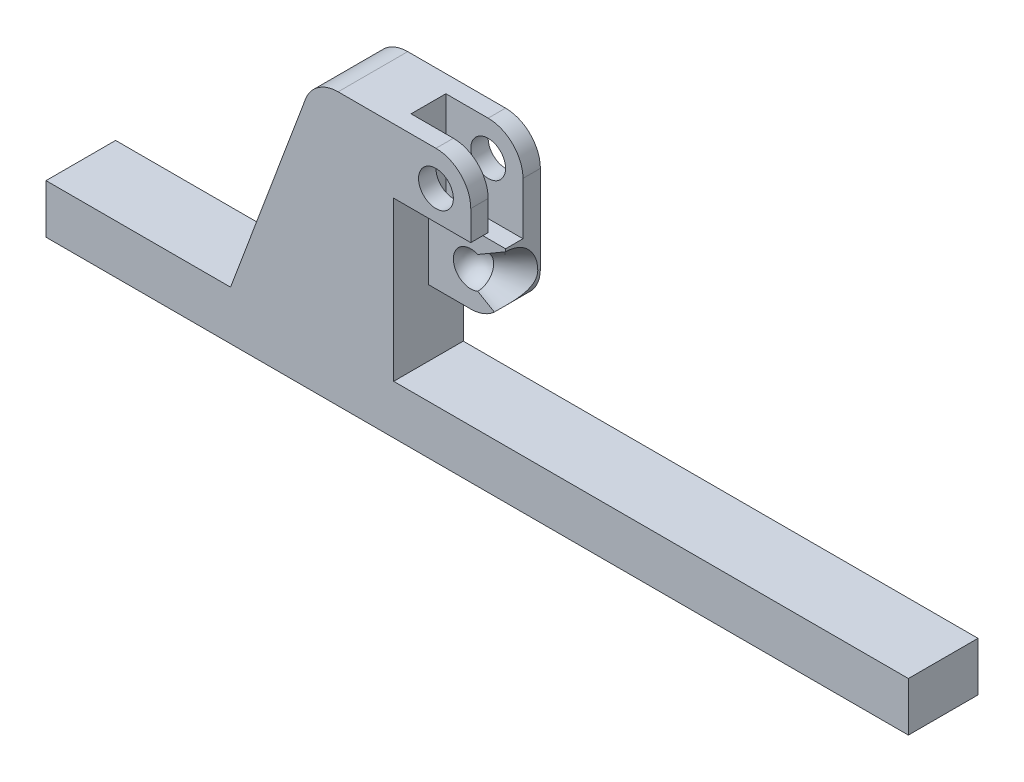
from build123d import *

# Parameters (mm, degrees)
ESQUISSE1_R             = 5
BASE_EXTRUSION_DEPTH    = 10
ESQUISSE6_W             = 25.109407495
ESQUISSE6_H             = 26.526756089
ENL_V_MAT_EXTRU_3_DEPTH = 10
ESQUISSE7_W             = 38.267391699
ESQUISSE7_H             = 10
ENL_V_MAT_EXTRU_4_DEPTH = 25


with BuildPart() as part:
    # Esquisse1 → Base-Extrusion (new, symmetric)
    with BuildSketch(Plane.XY):
        with BuildLine():
            Line((0, 35), (-28.108181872, 35))
            ThreePointArc((-28.108181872, 35), (-33.80742751, 33.216970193), (-37.474288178, 28.503719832))
            Line((-37.474288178, 28.503719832), (-59.006773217, -29.056688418))
            Line((-59.006773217, -29.056688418), (-112.028230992, -29.056688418))
            Line((-112.028230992, -29.056688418), (-112.028230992, -43.144779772))
            Line((-112.028230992, -43.144779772), (135.723083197, -43.144779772))
            Line((135.723083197, -43.144779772), (135.723083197, -29.056688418))
            Line((135.723083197, -29.056688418), (-12.150978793, -29.056688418))
            Line((-12.150978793, -29.056688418), (-12.150978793, -10))
            Line((-12.150978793, -10), (0, -10))
            ThreePointArc((0, -10), (7.071067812, -7.071067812), (10, 0))
            Line((10, 0), (10, 25))
            ThreePointArc((10, 25), (7.071067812, 32.071067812), (0, 35))
        make_face()
        with Locations((0, 25)):
            Circle(ESQUISSE1_R, mode=Mode.SUBTRACT)
    extrude(amount=BASE_EXTRUSION_DEPTH, both=True)

    # Esquisse5 → Enl_vement de mati_re-R_volution2 (revolve, cut)
    with BuildSketch(Plane.XY, mode=Mode.PRIVATE) as enl_vement_de_mati_re_r_volution2_sk:
        with BuildLine():
            Line((2.000376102, 4.582411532), (12.830688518, 10.906188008))
            Line((12.830688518, 10.906188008), (12.830688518, 0))
            Line((12.830688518, 0), (-5, 0))
            ThreePointArc((-5, 0), (-2.738441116, 4.183412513), (2.000376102, 4.582411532))
        make_face()
    revolve(enl_vement_de_mati_re_r_volution2_sk.sketch.rotate(Axis((-9.237122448, 0, 0), (1, 0, 0)), 90), axis=Axis((-9.237122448, 0, 0), (1, 0, 0)), mode=Mode.SUBTRACT)

    # Esquisse6 → Enl_v. mat.-Extru.3 (cut)
    with BuildSketch(Plane.XY.offset(10)):
        with Locations((0.403724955, 3.263378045)):
            Rectangle(ESQUISSE6_W, ESQUISSE6_H)
    extrude(amount=-ENL_V_MAT_EXTRU_3_DEPTH, mode=Mode.SUBTRACT)

    # Esquisse7 → Enl_v. mat.-Extru.4 (cut)
    with BuildSketch(Plane(origin=(0, 35, 0), x_dir=(-1, 0, 0), z_dir=(0, 1, 0))):
        with Locations((-6.982717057, 0)):
            Rectangle(ESQUISSE7_W, ESQUISSE7_H)
    extrude(amount=-ENL_V_MAT_EXTRU_4_DEPTH, mode=Mode.SUBTRACT)


solid = part.part
